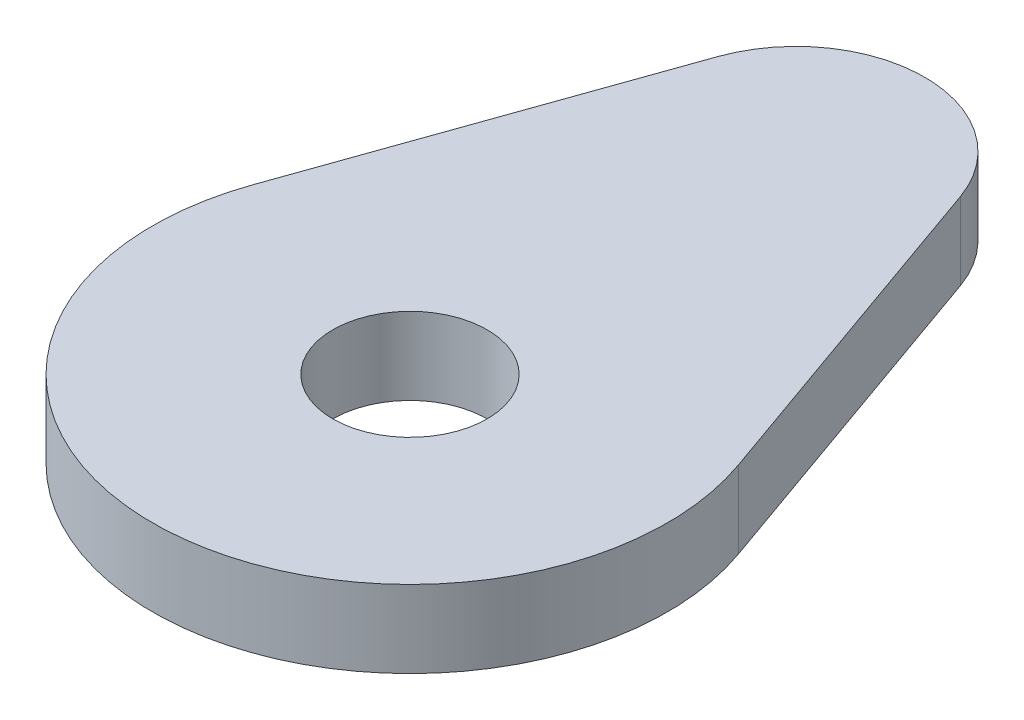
ISO-10303-21;
HEADER;
FILE_DESCRIPTION(('STEP AP214'),'2;1');
FILE_NAME('part.step','',(''),(''),'','','');
FILE_SCHEMA(('AUTOMOTIVE_DESIGN { 1 0 10303 214 1 1 1 1 }'));
ENDSEC;
DATA;
#1=APPLICATION_CONTEXT('core data for automotive mechanical design processes');
#2=APPLICATION_PROTOCOL_DEFINITION('international standard','automotive_design',2000,#1);
#3=PRODUCT_CONTEXT('',#1,'mechanical');
#4=PRODUCT('Part','Part','',(#3));
#5=PRODUCT_RELATED_PRODUCT_CATEGORY('part','',(#4));
#6=PRODUCT_DEFINITION_FORMATION('','',#4);
#7=PRODUCT_DEFINITION_CONTEXT('part definition',#1,'design');
#8=PRODUCT_DEFINITION('design','',#6,#7);
#9=PRODUCT_DEFINITION_SHAPE('','',#8);
#10=(LENGTH_UNIT() NAMED_UNIT(*) SI_UNIT(.MILLI.,.METRE.));
#11=(NAMED_UNIT(*) PLANE_ANGLE_UNIT() SI_UNIT($,.RADIAN.));
#12=(NAMED_UNIT(*) SI_UNIT($,.STERADIAN.) SOLID_ANGLE_UNIT());
#13=UNCERTAINTY_MEASURE_WITH_UNIT(LENGTH_MEASURE(1.E-05),#10,'distance_accuracy_value','');
#14=(GEOMETRIC_REPRESENTATION_CONTEXT(3) GLOBAL_UNCERTAINTY_ASSIGNED_CONTEXT((#13)) GLOBAL_UNIT_ASSIGNED_CONTEXT((#10,
#11,#12)) REPRESENTATION_CONTEXT('',''));
#15=CARTESIAN_POINT('',(0.,0.,0.));
#16=DIRECTION('',(0.,0.,1.));
#17=DIRECTION('',(1.,0.,0.));
#18=AXIS2_PLACEMENT_3D('',#15,#16,#17);
#19=CARTESIAN_POINT('',(0.,3.,-15.));
#20=DIRECTION('',(0.,1.,0.));
#21=DIRECTION('',(0.,0.,1.));
#22=AXIS2_PLACEMENT_3D('',#19,#20,#21);
#23=PLANE('',#22);
#24=CARTESIAN_POINT('',(0.,3.,-15.));
#25=DIRECTION('',(0.,1.,0.));
#26=DIRECTION('',(0.,0.,1.));
#27=AXIS2_PLACEMENT_3D('',#24,#25,#26);
#28=CIRCLE('',#27,5.);
#29=CARTESIAN_POINT('',(4.71404520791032,3.,-16.6666666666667));
#30=VERTEX_POINT('',#29);
#31=CARTESIAN_POINT('',(-4.71404520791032,3.,-16.6666666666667));
#32=VERTEX_POINT('',#31);
#33=EDGE_CURVE('E99',#30,#32,#28,.T.);
#34=ORIENTED_EDGE('',*,*,#33,.T.);
#35=DIRECTION('',(-0.333333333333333,0.,0.942809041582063));
#36=VECTOR('',#35,1.);
#37=CARTESIAN_POINT('',(-4.71404520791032,3.,-16.6666666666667));
#38=LINE('',#37,#36);
#39=CARTESIAN_POINT('',(-9.42809041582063,3.,-3.33333333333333));
#40=VERTEX_POINT('',#39);
#41=EDGE_CURVE('E84',#32,#40,#38,.T.);
#42=ORIENTED_EDGE('',*,*,#41,.T.);
#43=CARTESIAN_POINT('',(0.,3.,0.));
#44=DIRECTION('',(0.,1.,0.));
#45=DIRECTION('',(0.,0.,1.));
#46=AXIS2_PLACEMENT_3D('',#43,#44,#45);
#47=CIRCLE('',#46,10.);
#48=CARTESIAN_POINT('',(9.42809041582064,3.,-3.33333333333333));
#49=VERTEX_POINT('',#48);
#50=EDGE_CURVE('E50',#40,#49,#47,.T.);
#51=ORIENTED_EDGE('',*,*,#50,.T.);
#52=DIRECTION('',(-0.333333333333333,0.,-0.942809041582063));
#53=VECTOR('',#52,1.);
#54=CARTESIAN_POINT('',(4.71404520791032,3.,-16.6666666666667));
#55=LINE('',#54,#53);
#56=EDGE_CURVE('E45',#49,#30,#55,.T.);
#57=ORIENTED_EDGE('',*,*,#56,.T.);
#58=EDGE_LOOP('',(#34,#42,#51,#57));
#59=FACE_BOUND('',#58,.T.);
#60=CARTESIAN_POINT('',(0.,3.,0.));
#61=DIRECTION('',(0.,1.,0.));
#62=DIRECTION('',(0.,0.,1.));
#63=AXIS2_PLACEMENT_3D('',#60,#61,#62);
#64=CIRCLE('',#63,3.);
#65=CARTESIAN_POINT('',(0.,3.,3.));
#66=VERTEX_POINT('',#65);
#67=EDGE_CURVE('E89',#66,#66,#64,.T.);
#68=ORIENTED_EDGE('',*,*,#67,.F.);
#69=EDGE_LOOP('',(#68));
#70=FACE_BOUND('',#69,.T.);
#71=ADVANCED_FACE('F30',(#59,#70),#23,.T.);
#72=CARTESIAN_POINT('',(0.,0.,-15.));
#73=DIRECTION('',(0.,1.,0.));
#74=DIRECTION('',(0.,0.,1.));
#75=AXIS2_PLACEMENT_3D('',#72,#73,#74);
#76=PLANE('',#75);
#77=CARTESIAN_POINT('',(0.,0.,-15.));
#78=DIRECTION('',(0.,1.,0.));
#79=DIRECTION('',(0.,0.,1.));
#80=AXIS2_PLACEMENT_3D('',#77,#78,#79);
#81=CIRCLE('',#80,5.);
#82=CARTESIAN_POINT('',(4.71404520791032,0.,-16.6666666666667));
#83=VERTEX_POINT('',#82);
#84=CARTESIAN_POINT('',(-4.71404520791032,0.,-16.6666666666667));
#85=VERTEX_POINT('',#84);
#86=EDGE_CURVE('E76',#83,#85,#81,.T.);
#87=ORIENTED_EDGE('',*,*,#86,.F.);
#88=DIRECTION('',(-0.333333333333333,0.,-0.942809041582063));
#89=VECTOR('',#88,1.);
#90=CARTESIAN_POINT('',(4.71404520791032,0.,-16.6666666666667));
#91=LINE('',#90,#89);
#92=CARTESIAN_POINT('',(9.42809041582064,0.,-3.33333333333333));
#93=VERTEX_POINT('',#92);
#94=EDGE_CURVE('E97',#93,#83,#91,.T.);
#95=ORIENTED_EDGE('',*,*,#94,.F.);
#96=CARTESIAN_POINT('',(0.,0.,0.));
#97=DIRECTION('',(0.,1.,0.));
#98=DIRECTION('',(0.,0.,1.));
#99=AXIS2_PLACEMENT_3D('',#96,#97,#98);
#100=CIRCLE('',#99,10.);
#101=CARTESIAN_POINT('',(-9.42809041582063,0.,-3.33333333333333));
#102=VERTEX_POINT('',#101);
#103=EDGE_CURVE('E77',#102,#93,#100,.T.);
#104=ORIENTED_EDGE('',*,*,#103,.F.);
#105=DIRECTION('',(-0.333333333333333,0.,0.942809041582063));
#106=VECTOR('',#105,1.);
#107=CARTESIAN_POINT('',(-4.71404520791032,0.,-16.6666666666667));
#108=LINE('',#107,#106);
#109=EDGE_CURVE('E71',#85,#102,#108,.T.);
#110=ORIENTED_EDGE('',*,*,#109,.F.);
#111=EDGE_LOOP('',(#87,#95,#104,#110));
#112=FACE_BOUND('',#111,.T.);
#113=CARTESIAN_POINT('',(0.,0.,0.));
#114=DIRECTION('',(0.,1.,0.));
#115=DIRECTION('',(0.,0.,1.));
#116=AXIS2_PLACEMENT_3D('',#113,#114,#115);
#117=CIRCLE('',#116,3.);
#118=CARTESIAN_POINT('',(0.,0.,3.));
#119=VERTEX_POINT('',#118);
#120=EDGE_CURVE('E92',#119,#119,#117,.T.);
#121=ORIENTED_EDGE('',*,*,#120,.T.);
#122=EDGE_LOOP('',(#121));
#123=FACE_BOUND('',#122,.T.);
#124=ADVANCED_FACE('F72',(#112,#123),#76,.F.);
#125=CARTESIAN_POINT('',(0.,3.,-15.));
#126=DIRECTION('',(0.,-1.,0.));
#127=DIRECTION('',(0.,0.,-1.));
#128=AXIS2_PLACEMENT_3D('',#125,#126,#127);
#129=CYLINDRICAL_SURFACE('',#128,5.);
#130=ORIENTED_EDGE('',*,*,#86,.T.);
#131=DIRECTION('',(0.,-1.,0.));
#132=VECTOR('',#131,1.);
#133=CARTESIAN_POINT('',(-4.71404520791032,3.,-16.6666666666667));
#134=LINE('',#133,#132);
#135=EDGE_CURVE('E11',#32,#85,#134,.T.);
#136=ORIENTED_EDGE('',*,*,#135,.F.);
#137=ORIENTED_EDGE('',*,*,#33,.F.);
#138=DIRECTION('',(0.,-1.,0.));
#139=VECTOR('',#138,1.);
#140=CARTESIAN_POINT('',(4.71404520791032,3.,-16.6666666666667));
#141=LINE('',#140,#139);
#142=EDGE_CURVE('E88',#30,#83,#141,.T.);
#143=ORIENTED_EDGE('',*,*,#142,.T.);
#144=EDGE_LOOP('',(#130,#136,#137,#143));
#145=FACE_BOUND('',#144,.T.);
#146=ADVANCED_FACE('F32',(#145),#129,.T.);
#147=CARTESIAN_POINT('',(-4.71404520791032,3.,-16.6666666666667));
#148=DIRECTION('',(0.942809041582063,0.,0.333333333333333));
#149=DIRECTION('',(0.333333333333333,0.,-0.942809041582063));
#150=AXIS2_PLACEMENT_3D('',#147,#148,#149);
#151=PLANE('',#150);
#152=ORIENTED_EDGE('',*,*,#109,.T.);
#153=DIRECTION('',(0.,-1.,0.));
#154=VECTOR('',#153,1.);
#155=CARTESIAN_POINT('',(-9.42809041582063,3.,-3.33333333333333));
#156=LINE('',#155,#154);
#157=EDGE_CURVE('E38',#40,#102,#156,.T.);
#158=ORIENTED_EDGE('',*,*,#157,.F.);
#159=ORIENTED_EDGE('',*,*,#41,.F.);
#160=ORIENTED_EDGE('',*,*,#135,.T.);
#161=EDGE_LOOP('',(#152,#158,#159,#160));
#162=FACE_BOUND('',#161,.T.);
#163=ADVANCED_FACE('F83',(#162),#151,.F.);
#164=CARTESIAN_POINT('',(0.,3.,0.));
#165=DIRECTION('',(0.,-1.,0.));
#166=DIRECTION('',(0.,0.,-1.));
#167=AXIS2_PLACEMENT_3D('',#164,#165,#166);
#168=CYLINDRICAL_SURFACE('',#167,10.);
#169=ORIENTED_EDGE('',*,*,#103,.T.);
#170=DIRECTION('',(0.,-1.,0.));
#171=VECTOR('',#170,1.);
#172=CARTESIAN_POINT('',(9.42809041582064,3.,-3.33333333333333));
#173=LINE('',#172,#171);
#174=EDGE_CURVE('E105',#49,#93,#173,.T.);
#175=ORIENTED_EDGE('',*,*,#174,.F.);
#176=ORIENTED_EDGE('',*,*,#50,.F.);
#177=ORIENTED_EDGE('',*,*,#157,.T.);
#178=EDGE_LOOP('',(#169,#175,#176,#177));
#179=FACE_BOUND('',#178,.T.);
#180=ADVANCED_FACE('F108',(#179),#168,.T.);
#181=CARTESIAN_POINT('',(4.71404520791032,3.,-16.6666666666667));
#182=DIRECTION('',(-0.942809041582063,0.,0.333333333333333));
#183=DIRECTION('',(0.333333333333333,0.,0.942809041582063));
#184=AXIS2_PLACEMENT_3D('',#181,#182,#183);
#185=PLANE('',#184);
#186=ORIENTED_EDGE('',*,*,#94,.T.);
#187=ORIENTED_EDGE('',*,*,#142,.F.);
#188=ORIENTED_EDGE('',*,*,#56,.F.);
#189=ORIENTED_EDGE('',*,*,#174,.T.);
#190=EDGE_LOOP('',(#186,#187,#188,#189));
#191=FACE_BOUND('',#190,.T.);
#192=ADVANCED_FACE('F110',(#191),#185,.F.);
#193=CARTESIAN_POINT('',(0.,3.,0.));
#194=DIRECTION('',(0.,-1.,0.));
#195=DIRECTION('',(0.,0.,-1.));
#196=AXIS2_PLACEMENT_3D('',#193,#194,#195);
#197=CYLINDRICAL_SURFACE('',#196,3.);
#198=ORIENTED_EDGE('',*,*,#67,.T.);
#199=EDGE_LOOP('',(#198));
#200=FACE_BOUND('',#199,.T.);
#201=ORIENTED_EDGE('',*,*,#120,.F.);
#202=EDGE_LOOP('',(#201));
#203=FACE_BOUND('',#202,.T.);
#204=ADVANCED_FACE('F116',(#200,#203),#197,.F.);
#205=CLOSED_SHELL('',(#71,#124,#146,#163,#180,#192,#204));
#206=MANIFOLD_SOLID_BREP('B2',#205);
#207=ADVANCED_BREP_SHAPE_REPRESENTATION('',(#18,#206),#14);
#208=SHAPE_DEFINITION_REPRESENTATION(#9,#207);
ENDSEC;
END-ISO-10303-21;
